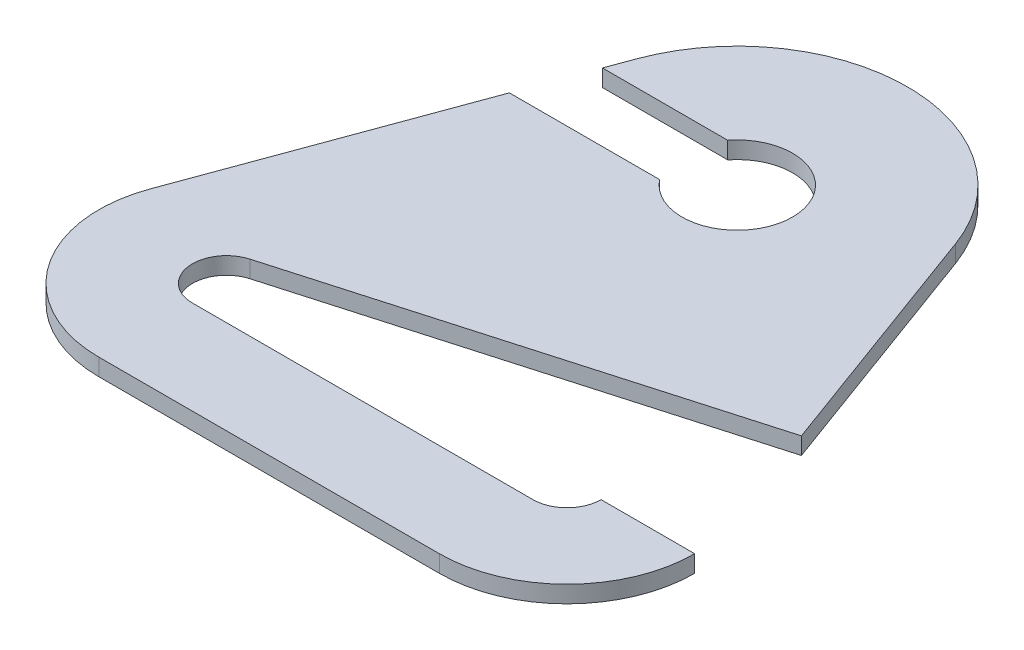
ISO-10303-21;
HEADER;
FILE_DESCRIPTION(('STEP AP214'),'2;1');
FILE_NAME('part.step','',(''),(''),'','','');
FILE_SCHEMA(('AUTOMOTIVE_DESIGN { 1 0 10303 214 1 1 1 1 }'));
ENDSEC;
DATA;
#1=APPLICATION_CONTEXT('core data for automotive mechanical design processes');
#2=APPLICATION_PROTOCOL_DEFINITION('international standard','automotive_design',2000,#1);
#3=PRODUCT_CONTEXT('',#1,'mechanical');
#4=PRODUCT('Part','Part','',(#3));
#5=PRODUCT_RELATED_PRODUCT_CATEGORY('part','',(#4));
#6=PRODUCT_DEFINITION_FORMATION('','',#4);
#7=PRODUCT_DEFINITION_CONTEXT('part definition',#1,'design');
#8=PRODUCT_DEFINITION('design','',#6,#7);
#9=PRODUCT_DEFINITION_SHAPE('','',#8);
#10=(LENGTH_UNIT() NAMED_UNIT(*) SI_UNIT(.MILLI.,.METRE.));
#11=(NAMED_UNIT(*) PLANE_ANGLE_UNIT() SI_UNIT($,.RADIAN.));
#12=(NAMED_UNIT(*) SI_UNIT($,.STERADIAN.) SOLID_ANGLE_UNIT());
#13=UNCERTAINTY_MEASURE_WITH_UNIT(LENGTH_MEASURE(1.E-05),#10,'distance_accuracy_value','');
#14=(GEOMETRIC_REPRESENTATION_CONTEXT(3) GLOBAL_UNCERTAINTY_ASSIGNED_CONTEXT((#13)) GLOBAL_UNIT_ASSIGNED_CONTEXT((#10,
#11,#12)) REPRESENTATION_CONTEXT('',''));
#15=CARTESIAN_POINT('',(0.,0.,0.));
#16=DIRECTION('',(0.,0.,1.));
#17=DIRECTION('',(1.,0.,0.));
#18=AXIS2_PLACEMENT_3D('',#15,#16,#17);
#19=CARTESIAN_POINT('',(20.,2.,-40.));
#20=DIRECTION('',(0.,-1.,0.));
#21=DIRECTION('',(0.,0.,-1.));
#22=AXIS2_PLACEMENT_3D('',#19,#20,#21);
#23=CYLINDRICAL_SURFACE('',#22,6.5);
#24=CARTESIAN_POINT('',(20.,0.,-40.));
#25=DIRECTION('',(0.,-1.,0.));
#26=DIRECTION('',(0.,0.,1.));
#27=AXIS2_PLACEMENT_3D('',#24,#25,#26);
#28=CIRCLE('',#27,6.5);
#29=CARTESIAN_POINT('',(14.8765246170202,0.,-44.));
#30=VERTEX_POINT('',#29);
#31=CARTESIAN_POINT('',(14.8765246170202,0.,-36.));
#32=VERTEX_POINT('',#31);
#33=EDGE_CURVE('E140',#30,#32,#28,.T.);
#34=ORIENTED_EDGE('',*,*,#33,.T.);
#35=DIRECTION('',(0.,-1.,0.));
#36=VECTOR('',#35,1.);
#37=CARTESIAN_POINT('',(14.8765246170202,2.,-36.));
#38=LINE('',#37,#36);
#39=CARTESIAN_POINT('',(14.8765246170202,2.,-36.));
#40=VERTEX_POINT('',#39);
#41=EDGE_CURVE('E11',#40,#32,#38,.T.);
#42=ORIENTED_EDGE('',*,*,#41,.F.);
#43=CARTESIAN_POINT('',(20.,2.,-40.));
#44=DIRECTION('',(0.,-1.,0.));
#45=DIRECTION('',(0.,0.,1.));
#46=AXIS2_PLACEMENT_3D('',#43,#44,#45);
#47=CIRCLE('',#46,6.5);
#48=CARTESIAN_POINT('',(14.8765246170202,2.,-44.));
#49=VERTEX_POINT('',#48);
#50=EDGE_CURVE('E181',#49,#40,#47,.T.);
#51=ORIENTED_EDGE('',*,*,#50,.F.);
#52=DIRECTION('',(0.,-1.,0.));
#53=VECTOR('',#52,1.);
#54=CARTESIAN_POINT('',(14.8765246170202,2.,-44.));
#55=LINE('',#54,#53);
#56=EDGE_CURVE('E153',#49,#30,#55,.T.);
#57=ORIENTED_EDGE('',*,*,#56,.T.);
#58=EDGE_LOOP('',(#34,#42,#51,#57));
#59=FACE_BOUND('',#58,.T.);
#60=ADVANCED_FACE('F30',(#59),#23,.F.);
#61=CARTESIAN_POINT('',(14.8765246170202,2.,-36.));
#62=DIRECTION('',(0.,0.,1.));
#63=DIRECTION('',(1.,0.,0.));
#64=AXIS2_PLACEMENT_3D('',#61,#62,#63);
#65=PLANE('',#64);
#66=DIRECTION('',(-1.,0.,0.));
#67=VECTOR('',#66,1.);
#68=CARTESIAN_POINT('',(14.8765246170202,0.,-36.));
#69=LINE('',#68,#67);
#70=CARTESIAN_POINT('',(-2.77076712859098,0.,-36.));
#71=VERTEX_POINT('',#70);
#72=EDGE_CURVE('E136',#32,#71,#69,.T.);
#73=ORIENTED_EDGE('',*,*,#72,.T.);
#74=DIRECTION('',(0.,-1.,0.));
#75=VECTOR('',#74,1.);
#76=CARTESIAN_POINT('',(-2.77076712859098,2.,-36.));
#77=LINE('',#76,#75);
#78=CARTESIAN_POINT('',(-2.77076712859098,2.,-36.));
#79=VERTEX_POINT('',#78);
#80=EDGE_CURVE('E37',#79,#71,#77,.T.);
#81=ORIENTED_EDGE('',*,*,#80,.F.);
#82=DIRECTION('',(-1.,0.,0.));
#83=VECTOR('',#82,1.);
#84=CARTESIAN_POINT('',(14.8765246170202,2.,-36.));
#85=LINE('',#84,#83);
#86=EDGE_CURVE('E149',#40,#79,#85,.T.);
#87=ORIENTED_EDGE('',*,*,#86,.F.);
#88=ORIENTED_EDGE('',*,*,#41,.T.);
#89=EDGE_LOOP('',(#73,#81,#87,#88));
#90=FACE_BOUND('',#89,.T.);
#91=ADVANCED_FACE('F148',(#90),#65,.F.);
#92=CARTESIAN_POINT('',(-2.77076712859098,2.,-36.));
#93=DIRECTION('',(0.938819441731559,0.,0.34440972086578));
#94=DIRECTION('',(0.34440972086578,0.,-0.938819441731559));
#95=AXIS2_PLACEMENT_3D('',#92,#93,#94);
#96=PLANE('',#95);
#97=DIRECTION('',(-0.34440972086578,0.,0.938819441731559));
#98=VECTOR('',#97,1.);
#99=CARTESIAN_POINT('',(-2.77076712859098,0.,-36.));
#100=LINE('',#99,#98);
#101=CARTESIAN_POINT('',(-14.0822916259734,0.,-5.16614581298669));
#102=VERTEX_POINT('',#101);
#103=EDGE_CURVE('E142',#71,#102,#100,.T.);
#104=ORIENTED_EDGE('',*,*,#103,.T.);
#105=DIRECTION('',(0.,-1.,0.));
#106=VECTOR('',#105,1.);
#107=CARTESIAN_POINT('',(-14.0822916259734,2.,-5.16614581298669));
#108=LINE('',#107,#106);
#109=CARTESIAN_POINT('',(-14.0822916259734,2.,-5.16614581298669));
#110=VERTEX_POINT('',#109);
#111=EDGE_CURVE('E242',#110,#102,#108,.T.);
#112=ORIENTED_EDGE('',*,*,#111,.F.);
#113=DIRECTION('',(-0.34440972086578,0.,0.938819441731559));
#114=VECTOR('',#113,1.);
#115=CARTESIAN_POINT('',(-2.77076712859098,2.,-36.));
#116=LINE('',#115,#114);
#117=EDGE_CURVE('E184',#79,#110,#116,.T.);
#118=ORIENTED_EDGE('',*,*,#117,.F.);
#119=ORIENTED_EDGE('',*,*,#80,.T.);
#120=EDGE_LOOP('',(#104,#112,#118,#119));
#121=FACE_BOUND('',#120,.T.);
#122=ADVANCED_FACE('F246',(#121),#96,.F.);
#123=CARTESIAN_POINT('',(0.,2.,0.));
#124=DIRECTION('',(0.,-1.,0.));
#125=DIRECTION('',(0.,0.,-1.));
#126=AXIS2_PLACEMENT_3D('',#123,#124,#125);
#127=CYLINDRICAL_SURFACE('',#126,15.);
#128=CARTESIAN_POINT('',(0.,0.,0.));
#129=DIRECTION('',(0.,1.,0.));
#130=DIRECTION('',(0.,0.,1.));
#131=AXIS2_PLACEMENT_3D('',#128,#129,#130);
#132=CIRCLE('',#131,15.);
#133=CARTESIAN_POINT('',(0.,0.,15.));
#134=VERTEX_POINT('',#133);
#135=EDGE_CURVE('E157',#102,#134,#132,.T.);
#136=ORIENTED_EDGE('',*,*,#135,.T.);
#137=DIRECTION('',(0.,-1.,0.));
#138=VECTOR('',#137,1.);
#139=CARTESIAN_POINT('',(0.,2.,15.));
#140=LINE('',#139,#138);
#141=CARTESIAN_POINT('',(0.,2.,15.));
#142=VERTEX_POINT('',#141);
#143=EDGE_CURVE('E239',#142,#134,#140,.T.);
#144=ORIENTED_EDGE('',*,*,#143,.F.);
#145=CARTESIAN_POINT('',(0.,2.,0.));
#146=DIRECTION('',(0.,1.,0.));
#147=DIRECTION('',(0.,0.,1.));
#148=AXIS2_PLACEMENT_3D('',#145,#146,#147);
#149=CIRCLE('',#148,15.);
#150=EDGE_CURVE('E186',#110,#142,#149,.T.);
#151=ORIENTED_EDGE('',*,*,#150,.F.);
#152=ORIENTED_EDGE('',*,*,#111,.T.);
#153=EDGE_LOOP('',(#136,#144,#151,#152));
#154=FACE_BOUND('',#153,.T.);
#155=ADVANCED_FACE('F254',(#154),#127,.T.);
#156=CARTESIAN_POINT('',(0.,2.,15.));
#157=DIRECTION('',(0.,0.,-1.));
#158=DIRECTION('',(-1.,0.,0.));
#159=AXIS2_PLACEMENT_3D('',#156,#157,#158);
#160=PLANE('',#159);
#161=DIRECTION('',(1.,0.,0.));
#162=VECTOR('',#161,1.);
#163=CARTESIAN_POINT('',(0.,0.,15.));
#164=LINE('',#163,#162);
#165=CARTESIAN_POINT('',(40.,0.,15.));
#166=VERTEX_POINT('',#165);
#167=EDGE_CURVE('E159',#134,#166,#164,.T.);
#168=ORIENTED_EDGE('',*,*,#167,.T.);
#169=DIRECTION('',(0.,-1.,0.));
#170=VECTOR('',#169,1.);
#171=CARTESIAN_POINT('',(40.,2.,15.));
#172=LINE('',#171,#170);
#173=CARTESIAN_POINT('',(40.,2.,15.));
#174=VERTEX_POINT('',#173);
#175=EDGE_CURVE('E236',#174,#166,#172,.T.);
#176=ORIENTED_EDGE('',*,*,#175,.F.);
#177=DIRECTION('',(1.,0.,0.));
#178=VECTOR('',#177,1.);
#179=CARTESIAN_POINT('',(0.,2.,15.));
#180=LINE('',#179,#178);
#181=EDGE_CURVE('E188',#142,#174,#180,.T.);
#182=ORIENTED_EDGE('',*,*,#181,.F.);
#183=ORIENTED_EDGE('',*,*,#143,.T.);
#184=EDGE_LOOP('',(#168,#176,#182,#183));
#185=FACE_BOUND('',#184,.T.);
#186=ADVANCED_FACE('F257',(#185),#160,.F.);
#187=CARTESIAN_POINT('',(40.,2.,0.));
#188=DIRECTION('',(0.,-1.,0.));
#189=DIRECTION('',(0.,0.,-1.));
#190=AXIS2_PLACEMENT_3D('',#187,#188,#189);
#191=CYLINDRICAL_SURFACE('',#190,15.);
#192=CARTESIAN_POINT('',(40.,0.,0.));
#193=DIRECTION('',(0.,1.,0.));
#194=DIRECTION('',(0.,0.,1.));
#195=AXIS2_PLACEMENT_3D('',#192,#193,#194);
#196=CIRCLE('',#195,15.);
#197=CARTESIAN_POINT('',(55.,0.,0.));
#198=VERTEX_POINT('',#197);
#199=EDGE_CURVE('E161',#166,#198,#196,.T.);
#200=ORIENTED_EDGE('',*,*,#199,.T.);
#201=DIRECTION('',(0.,-1.,0.));
#202=VECTOR('',#201,1.);
#203=CARTESIAN_POINT('',(55.,2.,0.));
#204=LINE('',#203,#202);
#205=CARTESIAN_POINT('',(55.,2.,0.));
#206=VERTEX_POINT('',#205);
#207=EDGE_CURVE('E233',#206,#198,#204,.T.);
#208=ORIENTED_EDGE('',*,*,#207,.F.);
#209=CARTESIAN_POINT('',(40.,2.,0.));
#210=DIRECTION('',(0.,1.,0.));
#211=DIRECTION('',(0.,0.,1.));
#212=AXIS2_PLACEMENT_3D('',#209,#210,#211);
#213=CIRCLE('',#212,15.);
#214=EDGE_CURVE('E190',#174,#206,#213,.T.);
#215=ORIENTED_EDGE('',*,*,#214,.F.);
#216=ORIENTED_EDGE('',*,*,#175,.T.);
#217=EDGE_LOOP('',(#200,#208,#215,#216));
#218=FACE_BOUND('',#217,.T.);
#219=ADVANCED_FACE('F262',(#218),#191,.T.);
#220=CARTESIAN_POINT('',(44.,2.,0.));
#221=DIRECTION('',(0.,0.,1.));
#222=DIRECTION('',(1.,0.,0.));
#223=AXIS2_PLACEMENT_3D('',#220,#221,#222);
#224=PLANE('',#223);
#225=DIRECTION('',(-1.,0.,0.));
#226=VECTOR('',#225,1.);
#227=CARTESIAN_POINT('',(44.,0.,0.));
#228=LINE('',#227,#226);
#229=CARTESIAN_POINT('',(44.,0.,0.));
#230=VERTEX_POINT('',#229);
#231=EDGE_CURVE('E163',#198,#230,#228,.T.);
#232=ORIENTED_EDGE('',*,*,#231,.T.);
#233=DIRECTION('',(0.,-1.,0.));
#234=VECTOR('',#233,1.);
#235=CARTESIAN_POINT('',(44.,2.,0.));
#236=LINE('',#235,#234);
#237=CARTESIAN_POINT('',(44.,2.,0.));
#238=VERTEX_POINT('',#237);
#239=EDGE_CURVE('E230',#238,#230,#236,.T.);
#240=ORIENTED_EDGE('',*,*,#239,.F.);
#241=DIRECTION('',(-1.,0.,0.));
#242=VECTOR('',#241,1.);
#243=CARTESIAN_POINT('',(44.,2.,0.));
#244=LINE('',#243,#242);
#245=EDGE_CURVE('E192',#206,#238,#244,.T.);
#246=ORIENTED_EDGE('',*,*,#245,.F.);
#247=ORIENTED_EDGE('',*,*,#207,.T.);
#248=EDGE_LOOP('',(#232,#240,#246,#247));
#249=FACE_BOUND('',#248,.T.);
#250=ADVANCED_FACE('F268',(#249),#224,.F.);
#251=CARTESIAN_POINT('',(40.,2.,0.));
#252=DIRECTION('',(0.,-1.,0.));
#253=DIRECTION('',(0.,0.,-1.));
#254=AXIS2_PLACEMENT_3D('',#251,#252,#253);
#255=CYLINDRICAL_SURFACE('',#254,4.);
#256=CARTESIAN_POINT('',(40.,0.,0.));
#257=DIRECTION('',(0.,-1.,0.));
#258=DIRECTION('',(0.,0.,1.));
#259=AXIS2_PLACEMENT_3D('',#256,#257,#258);
#260=CIRCLE('',#259,4.);
#261=CARTESIAN_POINT('',(40.,0.,4.));
#262=VERTEX_POINT('',#261);
#263=EDGE_CURVE('E165',#230,#262,#260,.T.);
#264=ORIENTED_EDGE('',*,*,#263,.T.);
#265=DIRECTION('',(0.,-1.,0.));
#266=VECTOR('',#265,1.);
#267=CARTESIAN_POINT('',(40.,2.,4.));
#268=LINE('',#267,#266);
#269=CARTESIAN_POINT('',(40.,2.,4.));
#270=VERTEX_POINT('',#269);
#271=EDGE_CURVE('E227',#270,#262,#268,.T.);
#272=ORIENTED_EDGE('',*,*,#271,.F.);
#273=CARTESIAN_POINT('',(40.,2.,0.));
#274=DIRECTION('',(0.,-1.,0.));
#275=DIRECTION('',(0.,0.,1.));
#276=AXIS2_PLACEMENT_3D('',#273,#274,#275);
#277=CIRCLE('',#276,4.);
#278=EDGE_CURVE('E194',#238,#270,#277,.T.);
#279=ORIENTED_EDGE('',*,*,#278,.F.);
#280=ORIENTED_EDGE('',*,*,#239,.T.);
#281=EDGE_LOOP('',(#264,#272,#279,#280));
#282=FACE_BOUND('',#281,.T.);
#283=ADVANCED_FACE('F272',(#282),#255,.F.);
#284=CARTESIAN_POINT('',(40.,2.,4.));
#285=DIRECTION('',(0.,0.,1.));
#286=DIRECTION('',(1.,0.,0.));
#287=AXIS2_PLACEMENT_3D('',#284,#285,#286);
#288=PLANE('',#287);
#289=DIRECTION('',(-1.,0.,0.));
#290=VECTOR('',#289,1.);
#291=CARTESIAN_POINT('',(40.,0.,4.));
#292=LINE('',#291,#290);
#293=CARTESIAN_POINT('',(0.,0.,4.));
#294=VERTEX_POINT('',#293);
#295=EDGE_CURVE('E167',#262,#294,#292,.T.);
#296=ORIENTED_EDGE('',*,*,#295,.T.);
#297=DIRECTION('',(0.,-1.,0.));
#298=VECTOR('',#297,1.);
#299=CARTESIAN_POINT('',(0.,2.,4.));
#300=LINE('',#299,#298);
#301=CARTESIAN_POINT('',(0.,2.,4.));
#302=VERTEX_POINT('',#301);
#303=EDGE_CURVE('E224',#302,#294,#300,.T.);
#304=ORIENTED_EDGE('',*,*,#303,.F.);
#305=DIRECTION('',(-1.,0.,0.));
#306=VECTOR('',#305,1.);
#307=CARTESIAN_POINT('',(40.,2.,4.));
#308=LINE('',#307,#306);
#309=EDGE_CURVE('E196',#270,#302,#308,.T.);
#310=ORIENTED_EDGE('',*,*,#309,.F.);
#311=ORIENTED_EDGE('',*,*,#271,.T.);
#312=EDGE_LOOP('',(#296,#304,#310,#311));
#313=FACE_BOUND('',#312,.T.);
#314=ADVANCED_FACE('F277',(#313),#288,.F.);
#315=CARTESIAN_POINT('',(0.,2.,0.));
#316=DIRECTION('',(0.,-1.,0.));
#317=DIRECTION('',(0.,0.,-1.));
#318=AXIS2_PLACEMENT_3D('',#315,#316,#317);
#319=CYLINDRICAL_SURFACE('',#318,4.);
#320=CARTESIAN_POINT('',(0.,0.,0.));
#321=DIRECTION('',(0.,-1.,0.));
#322=DIRECTION('',(0.,0.,1.));
#323=AXIS2_PLACEMENT_3D('',#320,#321,#322);
#324=CIRCLE('',#323,4.);
#325=CARTESIAN_POINT('',(-1.1,0.,-3.84577690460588));
#326=VERTEX_POINT('',#325);
#327=EDGE_CURVE('E169',#294,#326,#324,.T.);
#328=ORIENTED_EDGE('',*,*,#327,.T.);
#329=DIRECTION('',(0.,-1.,0.));
#330=VECTOR('',#329,1.);
#331=CARTESIAN_POINT('',(-1.1,2.,-3.84577690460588));
#332=LINE('',#331,#330);
#333=CARTESIAN_POINT('',(-1.1,2.,-3.84577690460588));
#334=VERTEX_POINT('',#333);
#335=EDGE_CURVE('E221',#334,#326,#332,.T.);
#336=ORIENTED_EDGE('',*,*,#335,.F.);
#337=CARTESIAN_POINT('',(0.,2.,0.));
#338=DIRECTION('',(0.,-1.,0.));
#339=DIRECTION('',(0.,0.,1.));
#340=AXIS2_PLACEMENT_3D('',#337,#338,#339);
#341=CIRCLE('',#340,4.);
#342=EDGE_CURVE('E198',#302,#334,#341,.T.);
#343=ORIENTED_EDGE('',*,*,#342,.F.);
#344=ORIENTED_EDGE('',*,*,#303,.T.);
#345=EDGE_LOOP('',(#328,#336,#343,#344));
#346=FACE_BOUND('',#345,.T.);
#347=ADVANCED_FACE('F283',(#346),#319,.F.);
#348=CARTESIAN_POINT('',(-1.1,2.,-3.84577690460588));
#349=DIRECTION('',(-0.275,0.,-0.961444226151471));
#350=DIRECTION('',(-0.961444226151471,0.,0.275));
#351=AXIS2_PLACEMENT_3D('',#348,#349,#350);
#352=PLANE('',#351);
#353=DIRECTION('',(0.961444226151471,0.,-0.275));
#354=VECTOR('',#353,1.);
#355=CARTESIAN_POINT('',(-1.1,0.,-3.84577690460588));
#356=LINE('',#355,#354);
#357=CARTESIAN_POINT('',(49.2802475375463,0.,-18.2559399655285));
#358=VERTEX_POINT('',#357);
#359=EDGE_CURVE('E171',#326,#358,#356,.T.);
#360=ORIENTED_EDGE('',*,*,#359,.T.);
#361=DIRECTION('',(0.,-1.,0.));
#362=VECTOR('',#361,1.);
#363=CARTESIAN_POINT('',(49.2802475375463,2.,-18.2559399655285));
#364=LINE('',#363,#362);
#365=CARTESIAN_POINT('',(49.2802475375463,2.,-18.2559399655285));
#366=VERTEX_POINT('',#365);
#367=EDGE_CURVE('E218',#366,#358,#364,.T.);
#368=ORIENTED_EDGE('',*,*,#367,.F.);
#369=DIRECTION('',(0.961444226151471,0.,-0.275));
#370=VECTOR('',#369,1.);
#371=CARTESIAN_POINT('',(-1.1,2.,-3.84577690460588));
#372=LINE('',#371,#370);
#373=EDGE_CURVE('E200',#334,#366,#372,.T.);
#374=ORIENTED_EDGE('',*,*,#373,.F.);
#375=ORIENTED_EDGE('',*,*,#335,.T.);
#376=EDGE_LOOP('',(#360,#368,#374,#375));
#377=FACE_BOUND('',#376,.T.);
#378=ADVANCED_FACE('F287',(#377),#352,.F.);
#379=CARTESIAN_POINT('',(38.7763888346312,2.,-46.8881944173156));
#380=DIRECTION('',(-0.938819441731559,0.,0.344409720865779));
#381=DIRECTION('',(0.344409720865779,0.,0.938819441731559));
#382=AXIS2_PLACEMENT_3D('',#379,#380,#381);
#383=PLANE('',#382);
#384=DIRECTION('',(-0.344409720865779,0.,-0.938819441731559));
#385=VECTOR('',#384,1.);
#386=CARTESIAN_POINT('',(38.7763888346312,0.,-46.8881944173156));
#387=LINE('',#386,#385);
#388=CARTESIAN_POINT('',(38.7763888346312,0.,-46.8881944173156));
#389=VERTEX_POINT('',#388);
#390=EDGE_CURVE('E173',#358,#389,#387,.T.);
#391=ORIENTED_EDGE('',*,*,#390,.T.);
#392=DIRECTION('',(0.,-1.,0.));
#393=VECTOR('',#392,1.);
#394=CARTESIAN_POINT('',(38.7763888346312,2.,-46.8881944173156));
#395=LINE('',#394,#393);
#396=CARTESIAN_POINT('',(38.7763888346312,2.,-46.8881944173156));
#397=VERTEX_POINT('',#396);
#398=EDGE_CURVE('E215',#397,#389,#395,.T.);
#399=ORIENTED_EDGE('',*,*,#398,.F.);
#400=DIRECTION('',(-0.344409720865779,0.,-0.938819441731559));
#401=VECTOR('',#400,1.);
#402=CARTESIAN_POINT('',(38.7763888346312,2.,-46.8881944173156));
#403=LINE('',#402,#401);
#404=EDGE_CURVE('E202',#366,#397,#403,.T.);
#405=ORIENTED_EDGE('',*,*,#404,.F.);
#406=ORIENTED_EDGE('',*,*,#367,.T.);
#407=EDGE_LOOP('',(#391,#399,#405,#406));
#408=FACE_BOUND('',#407,.T.);
#409=ADVANCED_FACE('F292',(#408),#383,.F.);
#410=CARTESIAN_POINT('',(20.,2.,-40.));
#411=DIRECTION('',(0.,-1.,0.));
#412=DIRECTION('',(0.,0.,-1.));
#413=AXIS2_PLACEMENT_3D('',#410,#411,#412);
#414=CYLINDRICAL_SURFACE('',#413,20.);
#415=CARTESIAN_POINT('',(20.,0.,-40.));
#416=DIRECTION('',(0.,1.,0.));
#417=DIRECTION('',(0.,0.,1.));
#418=AXIS2_PLACEMENT_3D('',#415,#416,#417);
#419=CIRCLE('',#418,20.);
#420=CARTESIAN_POINT('',(1.22361116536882,0.,-46.8881944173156));
#421=VERTEX_POINT('',#420);
#422=EDGE_CURVE('E175',#389,#421,#419,.T.);
#423=ORIENTED_EDGE('',*,*,#422,.T.);
#424=DIRECTION('',(0.,-1.,0.));
#425=VECTOR('',#424,1.);
#426=CARTESIAN_POINT('',(1.22361116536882,2.,-46.8881944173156));
#427=LINE('',#426,#425);
#428=CARTESIAN_POINT('',(1.22361116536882,2.,-46.8881944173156));
#429=VERTEX_POINT('',#428);
#430=EDGE_CURVE('E212',#429,#421,#427,.T.);
#431=ORIENTED_EDGE('',*,*,#430,.F.);
#432=CARTESIAN_POINT('',(20.,2.,-40.));
#433=DIRECTION('',(0.,1.,0.));
#434=DIRECTION('',(0.,0.,1.));
#435=AXIS2_PLACEMENT_3D('',#432,#433,#434);
#436=CIRCLE('',#435,20.);
#437=EDGE_CURVE('E204',#397,#429,#436,.T.);
#438=ORIENTED_EDGE('',*,*,#437,.F.);
#439=ORIENTED_EDGE('',*,*,#398,.T.);
#440=EDGE_LOOP('',(#423,#431,#438,#439));
#441=FACE_BOUND('',#440,.T.);
#442=ADVANCED_FACE('F296',(#441),#414,.T.);
#443=CARTESIAN_POINT('',(1.22361116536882,2.,-46.8881944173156));
#444=DIRECTION('',(0.938819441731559,0.,0.344409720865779));
#445=DIRECTION('',(0.344409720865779,0.,-0.938819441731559));
#446=AXIS2_PLACEMENT_3D('',#443,#444,#445);
#447=PLANE('',#446);
#448=DIRECTION('',(-0.344409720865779,0.,0.938819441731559));
#449=VECTOR('',#448,1.);
#450=CARTESIAN_POINT('',(1.22361116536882,0.,-46.8881944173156));
#451=LINE('',#450,#449);
#452=CARTESIAN_POINT('',(0.164065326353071,0.,-44.));
#453=VERTEX_POINT('',#452);
#454=EDGE_CURVE('E177',#421,#453,#451,.T.);
#455=ORIENTED_EDGE('',*,*,#454,.T.);
#456=DIRECTION('',(0.,-1.,0.));
#457=VECTOR('',#456,1.);
#458=CARTESIAN_POINT('',(0.164065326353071,2.,-44.));
#459=LINE('',#458,#457);
#460=CARTESIAN_POINT('',(0.164065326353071,2.,-44.));
#461=VERTEX_POINT('',#460);
#462=EDGE_CURVE('E209',#461,#453,#459,.T.);
#463=ORIENTED_EDGE('',*,*,#462,.F.);
#464=DIRECTION('',(-0.344409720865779,0.,0.938819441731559));
#465=VECTOR('',#464,1.);
#466=CARTESIAN_POINT('',(1.22361116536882,2.,-46.8881944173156));
#467=LINE('',#466,#465);
#468=EDGE_CURVE('E49',#429,#461,#467,.T.);
#469=ORIENTED_EDGE('',*,*,#468,.F.);
#470=ORIENTED_EDGE('',*,*,#430,.T.);
#471=EDGE_LOOP('',(#455,#463,#469,#470));
#472=FACE_BOUND('',#471,.T.);
#473=ADVANCED_FACE('F300',(#472),#447,.F.);
#474=CARTESIAN_POINT('',(14.8765246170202,2.,-44.));
#475=DIRECTION('',(0.,0.,-1.));
#476=DIRECTION('',(-1.,0.,0.));
#477=AXIS2_PLACEMENT_3D('',#474,#475,#476);
#478=PLANE('',#477);
#479=DIRECTION('',(1.,0.,0.));
#480=VECTOR('',#479,1.);
#481=CARTESIAN_POINT('',(14.8765246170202,0.,-44.));
#482=LINE('',#481,#480);
#483=EDGE_CURVE('E179',#453,#30,#482,.T.);
#484=ORIENTED_EDGE('',*,*,#483,.T.);
#485=ORIENTED_EDGE('',*,*,#56,.F.);
#486=DIRECTION('',(1.,0.,0.));
#487=VECTOR('',#486,1.);
#488=CARTESIAN_POINT('',(14.8765246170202,2.,-44.));
#489=LINE('',#488,#487);
#490=EDGE_CURVE('E44',#461,#49,#489,.T.);
#491=ORIENTED_EDGE('',*,*,#490,.F.);
#492=ORIENTED_EDGE('',*,*,#462,.T.);
#493=EDGE_LOOP('',(#484,#485,#491,#492));
#494=FACE_BOUND('',#493,.T.);
#495=ADVANCED_FACE('F302',(#494),#478,.F.);
#496=CARTESIAN_POINT('',(20.,2.,-40.));
#497=DIRECTION('',(0.,1.,0.));
#498=DIRECTION('',(0.,0.,1.));
#499=AXIS2_PLACEMENT_3D('',#496,#497,#498);
#500=PLANE('',#499);
#501=ORIENTED_EDGE('',*,*,#50,.T.);
#502=ORIENTED_EDGE('',*,*,#86,.T.);
#503=ORIENTED_EDGE('',*,*,#117,.T.);
#504=ORIENTED_EDGE('',*,*,#150,.T.);
#505=ORIENTED_EDGE('',*,*,#181,.T.);
#506=ORIENTED_EDGE('',*,*,#214,.T.);
#507=ORIENTED_EDGE('',*,*,#245,.T.);
#508=ORIENTED_EDGE('',*,*,#278,.T.);
#509=ORIENTED_EDGE('',*,*,#309,.T.);
#510=ORIENTED_EDGE('',*,*,#342,.T.);
#511=ORIENTED_EDGE('',*,*,#373,.T.);
#512=ORIENTED_EDGE('',*,*,#404,.T.);
#513=ORIENTED_EDGE('',*,*,#437,.T.);
#514=ORIENTED_EDGE('',*,*,#468,.T.);
#515=ORIENTED_EDGE('',*,*,#490,.T.);
#516=EDGE_LOOP('',(#501,#502,#503,#504,#505,#506,#507,#508,#509,#510,#511,#512,#513,#514,#515));
#517=FACE_BOUND('',#516,.T.);
#518=ADVANCED_FACE('F249',(#517),#500,.T.);
#519=CARTESIAN_POINT('',(20.,0.,-40.));
#520=DIRECTION('',(0.,1.,0.));
#521=DIRECTION('',(0.,0.,1.));
#522=AXIS2_PLACEMENT_3D('',#519,#520,#521);
#523=PLANE('',#522);
#524=ORIENTED_EDGE('',*,*,#33,.F.);
#525=ORIENTED_EDGE('',*,*,#483,.F.);
#526=ORIENTED_EDGE('',*,*,#454,.F.);
#527=ORIENTED_EDGE('',*,*,#422,.F.);
#528=ORIENTED_EDGE('',*,*,#390,.F.);
#529=ORIENTED_EDGE('',*,*,#359,.F.);
#530=ORIENTED_EDGE('',*,*,#327,.F.);
#531=ORIENTED_EDGE('',*,*,#295,.F.);
#532=ORIENTED_EDGE('',*,*,#263,.F.);
#533=ORIENTED_EDGE('',*,*,#231,.F.);
#534=ORIENTED_EDGE('',*,*,#199,.F.);
#535=ORIENTED_EDGE('',*,*,#167,.F.);
#536=ORIENTED_EDGE('',*,*,#135,.F.);
#537=ORIENTED_EDGE('',*,*,#103,.F.);
#538=ORIENTED_EDGE('',*,*,#72,.F.);
#539=EDGE_LOOP('',(#524,#525,#526,#527,#528,#529,#530,#531,#532,#533,#534,#535,#536,#537,#538));
#540=FACE_BOUND('',#539,.T.);
#541=ADVANCED_FACE('F137',(#540),#523,.F.);
#542=CLOSED_SHELL('',(#60,#91,#122,#155,#186,#219,#250,#283,#314,#347,#378,#409,#442,#473,#495,
#518,#541));
#543=MANIFOLD_SOLID_BREP('B2',#542);
#544=ADVANCED_BREP_SHAPE_REPRESENTATION('',(#18,#543),#14);
#545=SHAPE_DEFINITION_REPRESENTATION(#9,#544);
ENDSEC;
END-ISO-10303-21;
